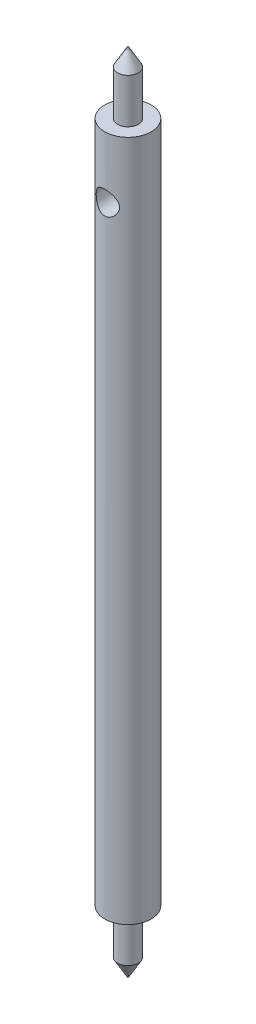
ISO-10303-21;
HEADER;
FILE_DESCRIPTION(('STEP AP214'),'2;1');
FILE_NAME('part.step','',(''),(''),'','','');
FILE_SCHEMA(('AUTOMOTIVE_DESIGN { 1 0 10303 214 1 1 1 1 }'));
ENDSEC;
DATA;
#1=APPLICATION_CONTEXT('core data for automotive mechanical design processes');
#2=APPLICATION_PROTOCOL_DEFINITION('international standard','automotive_design',2000,#1);
#3=PRODUCT_CONTEXT('',#1,'mechanical');
#4=PRODUCT('Part','Part','',(#3));
#5=PRODUCT_RELATED_PRODUCT_CATEGORY('part','',(#4));
#6=PRODUCT_DEFINITION_FORMATION('','',#4);
#7=PRODUCT_DEFINITION_CONTEXT('part definition',#1,'design');
#8=PRODUCT_DEFINITION('design','',#6,#7);
#9=PRODUCT_DEFINITION_SHAPE('','',#8);
#10=(LENGTH_UNIT() NAMED_UNIT(*) SI_UNIT(.MILLI.,.METRE.));
#11=(NAMED_UNIT(*) PLANE_ANGLE_UNIT() SI_UNIT($,.RADIAN.));
#12=(NAMED_UNIT(*) SI_UNIT($,.STERADIAN.) SOLID_ANGLE_UNIT());
#13=UNCERTAINTY_MEASURE_WITH_UNIT(LENGTH_MEASURE(1.E-05),#10,'distance_accuracy_value','');
#14=(GEOMETRIC_REPRESENTATION_CONTEXT(3) GLOBAL_UNCERTAINTY_ASSIGNED_CONTEXT((#13)) GLOBAL_UNIT_ASSIGNED_CONTEXT((#10,
#11,#12)) REPRESENTATION_CONTEXT('',''));
#15=CARTESIAN_POINT('',(0.,0.,0.));
#16=DIRECTION('',(0.,0.,1.));
#17=DIRECTION('',(1.,0.,0.));
#18=AXIS2_PLACEMENT_3D('',#15,#16,#17);
#19=CARTESIAN_POINT('',(0.,69.85,0.));
#20=DIRECTION('',(0.,-1.,0.));
#21=DIRECTION('',(0.,0.,-1.));
#22=AXIS2_PLACEMENT_3D('',#19,#20,#21);
#23=CYLINDRICAL_SURFACE('',#22,2.38125);
#24=CARTESIAN_POINT('',(0.,64.7603768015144,-2.38125));
#25=CARTESIAN_POINT('',(-0.0625934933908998,64.7603728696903,-2.38124658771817));
#26=CARTESIAN_POINT('',(-0.12526160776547,64.7554118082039,-2.37875553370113));
#27=CARTESIAN_POINT('',(-0.24874565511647,64.7357869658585,-2.36903604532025));
#28=CARTESIAN_POINT('',(-0.309557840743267,64.7211047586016,-2.36179861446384));
#29=CARTESIAN_POINT('',(-0.427355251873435,64.6827554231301,-2.34334382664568));
#30=CARTESIAN_POINT('',(-0.484354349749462,64.6591232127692,-2.33214194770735));
#31=CARTESIAN_POINT('',(-0.593493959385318,64.6037255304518,-2.30678565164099));
#32=CARTESIAN_POINT('',(-0.645634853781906,64.5719606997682,-2.29263146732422));
#33=CARTESIAN_POINT('',(-0.747126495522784,64.499014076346,-2.26166669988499));
#34=CARTESIAN_POINT('',(-0.796117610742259,64.4573788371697,-2.24474721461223));
#35=CARTESIAN_POINT('',(-0.88675302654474,64.3668496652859,-2.2105140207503));
#36=CARTESIAN_POINT('',(-0.928391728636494,64.3179502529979,-2.19320002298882));
#37=CARTESIAN_POINT('',(-1.00637816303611,64.2097325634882,-2.15859063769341));
#38=CARTESIAN_POINT('',(-1.04206516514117,64.1499003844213,-2.14140081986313));
#39=CARTESIAN_POINT('',(-1.10271904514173,64.0241331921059,-2.11081118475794));
#40=CARTESIAN_POINT('',(-1.12769358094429,63.9582025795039,-2.09740866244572));
#41=CARTESIAN_POINT('',(-1.16458893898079,63.8261349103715,-2.07713897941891));
#42=CARTESIAN_POINT('',(-1.1772017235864,63.7602465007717,-2.06992860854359));
#43=CARTESIAN_POINT('',(-1.19113338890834,63.6269269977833,-2.06194687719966));
#44=CARTESIAN_POINT('',(-1.19246343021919,63.5594974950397,-2.06116915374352));
#45=CARTESIAN_POINT('',(-1.18429955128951,63.433680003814,-2.06586451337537));
#46=CARTESIAN_POINT('',(-1.17608099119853,63.3751750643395,-2.07060121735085));
#47=CARTESIAN_POINT('',(-1.15126275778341,63.2605204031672,-2.08450134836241));
#48=CARTESIAN_POINT('',(-1.13466041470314,63.2043714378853,-2.09366618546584));
#49=CARTESIAN_POINT('',(-1.09324351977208,63.0944196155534,-2.1155915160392));
#50=CARTESIAN_POINT('',(-1.06824668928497,63.0407018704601,-2.12843079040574));
#51=CARTESIAN_POINT('',(-1.01089025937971,62.9379653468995,-2.15626240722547));
#52=CARTESIAN_POINT('',(-0.978527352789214,62.8889486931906,-2.17125571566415));
#53=CARTESIAN_POINT('',(-0.902572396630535,62.790462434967,-2.204003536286));
#54=CARTESIAN_POINT('',(-0.858076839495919,62.7417234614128,-2.22186710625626));
#55=CARTESIAN_POINT('',(-0.76147086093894,62.6520949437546,-2.25680138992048));
#56=CARTESIAN_POINT('',(-0.709356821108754,62.6112091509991,-2.27387172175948));
#57=CARTESIAN_POINT('',(-0.595927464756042,62.5366635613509,-2.30626428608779));
#58=CARTESIAN_POINT('',(-0.534297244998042,62.5034274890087,-2.3214685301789));
#59=CARTESIAN_POINT('',(-0.405367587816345,62.4480675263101,-2.34741102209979));
#60=CARTESIAN_POINT('',(-0.338072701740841,62.4259348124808,-2.35815281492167));
#61=CARTESIAN_POINT('',(-0.20570010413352,62.3952295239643,-2.37320534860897));
#62=CARTESIAN_POINT('',(-0.140900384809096,62.3856856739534,-2.37797504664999));
#63=CARTESIAN_POINT('',(-0.0104532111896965,62.3773828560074,-2.38211931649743));
#64=CARTESIAN_POINT('',(0.0551938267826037,62.3786187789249,-2.38149644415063));
#65=CARTESIAN_POINT('',(0.180061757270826,62.391279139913,-2.37519200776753));
#66=CARTESIAN_POINT('',(0.239386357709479,62.4019064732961,-2.36990626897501));
#67=CARTESIAN_POINT('',(0.355290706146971,62.4317977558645,-2.35532022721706));
#68=CARTESIAN_POINT('',(0.411870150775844,62.451062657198,-2.34601948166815));
#69=CARTESIAN_POINT('',(0.522551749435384,62.4981874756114,-2.323912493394));
#70=CARTESIAN_POINT('',(0.576536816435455,62.5262773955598,-2.31101362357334));
#71=CARTESIAN_POINT('',(0.679205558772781,62.589995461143,-2.28295169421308));
#72=CARTESIAN_POINT('',(0.727886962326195,62.6256268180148,-2.26778767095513));
#73=CARTESIAN_POINT('',(0.823635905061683,62.7074540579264,-2.23490101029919));
#74=CARTESIAN_POINT('',(0.870075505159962,62.754343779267,-2.21707334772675));
#75=CARTESIAN_POINT('',(0.954710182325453,62.8552876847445,-2.18196785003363));
#76=CARTESIAN_POINT('',(0.992899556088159,62.9093467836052,-2.1646904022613));
#77=CARTESIAN_POINT('',(1.06168973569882,63.0264025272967,-2.13182825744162));
#78=CARTESIAN_POINT('',(1.0918334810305,63.0897052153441,-2.11636605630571));
#79=CARTESIAN_POINT('',(1.14071736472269,63.2215059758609,-2.090428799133));
#80=CARTESIAN_POINT('',(1.15947219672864,63.2899972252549,-2.07994732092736));
#81=CARTESIAN_POINT('',(1.18331657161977,63.4231980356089,-2.06646662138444));
#82=CARTESIAN_POINT('',(1.18954509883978,63.4876394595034,-2.06284572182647));
#83=CARTESIAN_POINT('',(1.19144552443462,63.6167184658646,-2.06175000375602));
#84=CARTESIAN_POINT('',(1.18712199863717,63.6813559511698,-2.06427252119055));
#85=CARTESIAN_POINT('',(1.16910579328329,63.802499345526,-2.07451954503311));
#86=CARTESIAN_POINT('',(1.1563448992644,63.8591932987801,-2.081725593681));
#87=CARTESIAN_POINT('',(1.12296816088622,63.9695733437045,-2.09991741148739));
#88=CARTESIAN_POINT('',(1.10234978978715,64.0232584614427,-2.11090439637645));
#89=CARTESIAN_POINT('',(1.05229312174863,64.1300895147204,-2.13632093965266));
#90=CARTESIAN_POINT('',(1.02235532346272,64.1829568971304,-2.15093219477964));
#91=CARTESIAN_POINT('',(0.955061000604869,64.2832630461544,-2.18164566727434));
#92=CARTESIAN_POINT('',(0.917700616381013,64.330698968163,-2.19774865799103));
#93=CARTESIAN_POINT('',(0.831298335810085,64.424789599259,-2.23197328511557));
#94=CARTESIAN_POINT('',(0.781388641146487,64.4706490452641,-2.25010245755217));
#95=CARTESIAN_POINT('',(0.674078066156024,64.5535211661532,-2.28454448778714));
#96=CARTESIAN_POINT('',(0.61667317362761,64.5905290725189,-2.30085636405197));
#97=CARTESIAN_POINT('',(0.495218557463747,64.6546925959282,-2.33002942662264));
#98=CARTESIAN_POINT('',(0.43112472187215,64.6817767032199,-2.34286539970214));
#99=CARTESIAN_POINT('',(0.298539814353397,64.724429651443,-2.36340659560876));
#100=CARTESIAN_POINT('',(0.230061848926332,64.7400312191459,-2.37112639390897));
#101=CARTESIAN_POINT('',(0.134066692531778,64.7531109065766,-2.37762409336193));
#102=CARTESIAN_POINT('',(0.107348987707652,64.7558317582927,-2.37898025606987));
#103=CARTESIAN_POINT('',(0.0537587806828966,64.7594655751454,-2.3807939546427));
#104=CARTESIAN_POINT('',(0.0268862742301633,64.7603784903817,-2.38125146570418));
#105=CARTESIAN_POINT('',(0.,64.7603768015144,-2.38125));
#106=B_SPLINE_CURVE_WITH_KNOTS('',3,(#24,#25,#26,#27,#28,#29,#30,#31,#32,#33,#34,#35,#36,#37,
#38,#39,#40,#41,#42,#43,#44,#45,#46,#47,#48,#49,#50,#51,#52,#53,#54,#55,#56,#57,#58,#59,#60,#61,
#62,#63,#64,#65,#66,#67,#68,#69,#70,#71,#72,#73,#74,#75,#76,#77,#78,#79,#80,#81,#82,#83,#84,#85,
#86,#87,#88,#89,#90,#91,#92,#93,#94,#95,#96,#97,#98,#99,#100,#101,#102,#103,#104,#105),
.UNSPECIFIED.,.T.,.F.,(4,2,2,2,2,2,2,2,2,2,2,2,2,2,2,2,2,2,2,2,2,2,2,2,2,2,2,2,2,2,2,2,2,2,2,2,
2,2,2,2,4),(0.,0.187671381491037,0.375699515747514,0.56300150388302,0.75028872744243,
0.948906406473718,1.14767467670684,1.36185743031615,1.5758868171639,1.77710320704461,
1.97812053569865,2.15509926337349,2.33213438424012,2.51329317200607,2.69453345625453,
2.8987544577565,3.10307277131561,3.31687910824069,3.53051527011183,3.72645730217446,
3.92230647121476,4.10297598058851,4.28366541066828,4.46952119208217,4.65545627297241,
4.85965036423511,5.06398516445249,5.27821543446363,5.49216872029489,5.6855833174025,
5.87891405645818,6.05382723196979,6.22879670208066,6.41552156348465,6.60234377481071,
6.81186617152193,7.02150118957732,7.2326184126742,7.44313156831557,7.52374130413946,
7.60435326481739),.UNSPECIFIED.);
#107=CARTESIAN_POINT('',(0.,64.7603768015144,-2.38125));
#108=VERTEX_POINT('',#107);
#109=EDGE_CURVE('E11',#108,#108,#106,.T.);
#110=ORIENTED_EDGE('',*,*,#109,.T.);
#111=EDGE_LOOP('',(#110));
#112=FACE_BOUND('',#111,.T.);
#113=CARTESIAN_POINT('',(1.190625,63.5697518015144,2.0622229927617));
#114=CARTESIAN_POINT('',(1.19062066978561,63.507710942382,2.06222839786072));
#115=CARTESIAN_POINT('',(1.18574340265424,63.4455917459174,2.06506525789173));
#116=CARTESIAN_POINT('',(1.16648294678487,63.3232599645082,2.07600192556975));
#117=CARTESIAN_POINT('',(1.15207978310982,63.2630516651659,2.084112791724));
#118=CARTESIAN_POINT('',(1.11454400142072,63.1465421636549,2.10442190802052));
#119=CARTESIAN_POINT('',(1.09145778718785,63.0902220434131,2.11659839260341));
#120=CARTESIAN_POINT('',(1.03735289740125,62.9822686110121,2.14363297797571));
#121=CARTESIAN_POINT('',(1.00633379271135,62.9306355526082,2.15849122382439));
#122=CARTESIAN_POINT('',(0.93424359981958,62.8288190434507,2.19071272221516));
#123=CARTESIAN_POINT('',(0.892554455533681,62.7791063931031,2.20818150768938));
#124=CARTESIAN_POINT('',(0.801592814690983,62.6870124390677,2.24280392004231));
#125=CARTESIAN_POINT('',(0.752316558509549,62.6446347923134,2.25995738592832));
#126=CARTESIAN_POINT('',(0.643520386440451,62.5656177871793,2.29339945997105));
#127=CARTESIAN_POINT('',(0.583533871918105,62.5295577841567,2.30955182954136));
#128=CARTESIAN_POINT('',(0.457386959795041,62.4682559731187,2.33780118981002));
#129=CARTESIAN_POINT('',(0.391230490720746,62.4430073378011,2.34990073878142));
#130=CARTESIAN_POINT('',(0.259609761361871,62.4059103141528,2.3679204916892));
#131=CARTESIAN_POINT('',(0.194431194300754,62.3932362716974,2.37421912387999));
#132=CARTESIAN_POINT('',(0.0625919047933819,62.378929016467,2.38134029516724));
#133=CARTESIAN_POINT('',(-0.00406789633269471,62.3772891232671,2.38216614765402));
#134=CARTESIAN_POINT('',(-0.130769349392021,62.3847783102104,2.37842800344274));
#135=CARTESIAN_POINT('',(-0.190882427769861,62.3929833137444,2.37432646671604));
#136=CARTESIAN_POINT('',(-0.308745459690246,62.4182755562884,2.36189335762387));
#137=CARTESIAN_POINT('',(-0.366495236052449,62.4353634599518,2.353561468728));
#138=CARTESIAN_POINT('',(-0.478999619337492,62.4780469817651,2.33328666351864));
#139=CARTESIAN_POINT('',(-0.53370173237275,62.5037570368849,2.32129538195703));
#140=CARTESIAN_POINT('',(-0.638147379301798,62.5627966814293,2.294782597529));
#141=CARTESIAN_POINT('',(-0.687889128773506,62.5961289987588,2.28026018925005));
#142=CARTESIAN_POINT('',(-0.786019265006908,62.6730865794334,2.24842857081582));
#143=CARTESIAN_POINT('',(-0.833835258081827,62.7173869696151,2.23098569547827));
#144=CARTESIAN_POINT('',(-0.921668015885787,62.8132164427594,2.19615949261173));
#145=CARTESIAN_POINT('',(-0.96167878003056,62.8647510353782,2.17877622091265));
#146=CARTESIAN_POINT('',(-1.03525478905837,62.9775923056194,2.14484135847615));
#147=CARTESIAN_POINT('',(-1.06824936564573,63.0393117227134,2.12841268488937));
#148=CARTESIAN_POINT('',(-1.12313931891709,63.1684369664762,2.0999702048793));
#149=CARTESIAN_POINT('',(-1.14504627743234,63.235836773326,2.08795179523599));
#150=CARTESIAN_POINT('',(-1.17536143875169,63.3687915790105,2.07102832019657));
#151=CARTESIAN_POINT('',(-1.18470178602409,63.4340695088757,2.06563502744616));
#152=CARTESIAN_POINT('',(-1.19243111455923,63.5654671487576,2.06118522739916));
#153=CARTESIAN_POINT('',(-1.1908278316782,63.6315862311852,2.06212424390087));
#154=CARTESIAN_POINT('',(-1.17757103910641,63.7550772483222,2.06971506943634));
#155=CARTESIAN_POINT('',(-1.16703611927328,63.8126148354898,2.0757307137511));
#156=CARTESIAN_POINT('',(-1.1378758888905,63.9249959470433,2.09185694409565));
#157=CARTESIAN_POINT('',(-1.11924795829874,63.9798385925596,2.10196885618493));
#158=CARTESIAN_POINT('',(-1.0735241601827,64.0881634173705,2.12569689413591));
#159=CARTESIAN_POINT('',(-1.04607605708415,64.1414649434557,2.13945362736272));
#160=CARTESIAN_POINT('',(-0.983798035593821,64.2430136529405,2.16879629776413));
#161=CARTESIAN_POINT('',(-0.948964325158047,64.2912582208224,2.18438317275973));
#162=CARTESIAN_POINT('',(-0.867771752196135,64.3876858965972,2.21799148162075));
#163=CARTESIAN_POINT('',(-0.820513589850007,64.4350946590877,2.23607213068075));
#164=CARTESIAN_POINT('',(-0.71842847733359,64.5215519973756,2.27092948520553));
#165=CARTESIAN_POINT('',(-0.663598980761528,64.5605977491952,2.28770574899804));
#166=CARTESIAN_POINT('',(-0.545943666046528,64.6300911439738,2.31863933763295));
#167=CARTESIAN_POINT('',(-0.482945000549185,64.6602846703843,2.3327158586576));
#168=CARTESIAN_POINT('',(-0.351856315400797,64.7093441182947,2.35604869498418));
#169=CARTESIAN_POINT('',(-0.28377082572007,64.7282199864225,2.36530924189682));
#170=CARTESIAN_POINT('',(-0.151185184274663,64.7524812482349,2.37729126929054));
#171=CARTESIAN_POINT('',(-0.0869292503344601,64.7589455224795,2.3805347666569));
#172=CARTESIAN_POINT('',(0.0418218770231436,64.7613808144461,2.38175161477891));
#173=CARTESIAN_POINT('',(0.10631697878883,64.7573555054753,2.37972681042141));
#174=CARTESIAN_POINT('',(0.229240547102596,64.7396403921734,2.37093881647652));
#175=CARTESIAN_POINT('',(0.287788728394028,64.726604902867,2.36449665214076));
#176=CARTESIAN_POINT('',(0.401771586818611,64.6921218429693,2.34781836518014));
#177=CARTESIAN_POINT('',(0.457205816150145,64.6706730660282,2.33758169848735));
#178=CARTESIAN_POINT('',(0.566050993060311,64.6190174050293,2.31369311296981));
#179=CARTESIAN_POINT('',(0.619273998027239,64.5884751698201,2.2999138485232));
#180=CARTESIAN_POINT('',(0.720059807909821,64.5199206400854,2.27038058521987));
#181=CARTESIAN_POINT('',(0.767619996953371,64.4819049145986,2.25462568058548));
#182=CARTESIAN_POINT('',(0.860719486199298,64.3950964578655,2.22085626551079));
#183=CARTESIAN_POINT('',(0.905586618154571,64.3456077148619,2.20277291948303));
#184=CARTESIAN_POINT('',(0.986627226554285,64.2395370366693,2.16768850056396));
#185=CARTESIAN_POINT('',(1.02279301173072,64.1829488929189,2.15068839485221));
#186=CARTESIAN_POINT('',(1.08636325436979,64.061912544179,2.11930780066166));
#187=CARTESIAN_POINT('',(1.11345471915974,63.9972724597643,2.10502707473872));
#188=CARTESIAN_POINT('',(1.15595246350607,63.8634404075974,2.08200017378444));
#189=CARTESIAN_POINT('',(1.17139782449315,63.7942645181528,2.07323550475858));
#190=CARTESIAN_POINT('',(1.18391821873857,63.6985710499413,2.06608290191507));
#191=CARTESIAN_POINT('',(1.18642936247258,63.672898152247,2.06464053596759));
#192=CARTESIAN_POINT('',(1.18978371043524,63.6214053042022,2.06270942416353));
#193=CARTESIAN_POINT('',(1.19062680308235,63.59558534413,2.06222074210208));
#194=CARTESIAN_POINT('',(1.190625,63.5697518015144,2.0622229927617));
#195=B_SPLINE_CURVE_WITH_KNOTS('',3,(#113,#114,#115,#116,#117,#118,#119,#120,#121,#122,#123,
#124,#125,#126,#127,#128,#129,#130,#131,#132,#133,#134,#135,#136,#137,#138,#139,#140,#141,#142,
#143,#144,#145,#146,#147,#148,#149,#150,#151,#152,#153,#154,#155,#156,#157,#158,#159,#160,#161,
#162,#163,#164,#165,#166,#167,#168,#169,#170,#171,#172,#173,#174,#175,#176,#177,#178,#179,#180,
#181,#182,#183,#184,#185,#186,#187,#188,#189,#190,#191,#192,#193,#194),.UNSPECIFIED.,.T.,.F.,(4,
2,2,2,2,2,2,2,2,2,2,2,2,2,2,2,2,2,2,2,2,2,2,2,2,2,2,2,2,2,2,2,2,2,2,2,2,2,2,2,4),(0.,
0.18601387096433,0.372419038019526,0.557841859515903,0.743274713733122,0.944001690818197,
1.14482845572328,1.35919240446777,1.57342078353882,1.77240586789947,1.9712704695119,
2.15284166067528,2.33442643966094,2.5185235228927,2.70268659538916,2.90425812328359,
3.10598401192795,3.32052027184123,3.5348319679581,3.73216040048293,3.92934935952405,
4.1049676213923,4.28064278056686,4.46445437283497,4.64836057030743,4.85544904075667,
5.06260732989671,5.27523290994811,5.48767134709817,5.68061796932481,5.87349703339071,
6.0536664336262,6.23386167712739,6.42176393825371,6.60975266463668,6.81645006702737,
7.0233295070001,7.23674673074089,7.44944455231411,7.52689473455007,7.60435009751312),.UNSPECIFIED.);
#196=CARTESIAN_POINT('',(1.190625,63.5697518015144,2.0622229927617));
#197=VERTEX_POINT('',#196);
#198=EDGE_CURVE('E52',#197,#197,#195,.T.);
#199=ORIENTED_EDGE('',*,*,#198,.T.);
#200=EDGE_LOOP('',(#199));
#201=FACE_BOUND('',#200,.T.);
#202=CARTESIAN_POINT('',(0.,69.85,0.));
#203=DIRECTION('',(0.,1.,0.));
#204=DIRECTION('',(0.,0.,1.));
#205=AXIS2_PLACEMENT_3D('',#202,#203,#204);
#206=CIRCLE('',#205,2.38125);
#207=CARTESIAN_POINT('',(0.,69.85,2.38125));
#208=VERTEX_POINT('',#207);
#209=EDGE_CURVE('E90',#208,#208,#206,.T.);
#210=ORIENTED_EDGE('',*,*,#209,.F.);
#211=EDGE_LOOP('',(#210));
#212=FACE_BOUND('',#211,.T.);
#213=CARTESIAN_POINT('',(0.,0.,0.));
#214=DIRECTION('',(0.,1.,0.));
#215=DIRECTION('',(0.,0.,1.));
#216=AXIS2_PLACEMENT_3D('',#213,#214,#215);
#217=CIRCLE('',#216,2.38125);
#218=CARTESIAN_POINT('',(0.,0.,2.38125));
#219=VERTEX_POINT('',#218);
#220=EDGE_CURVE('E93',#219,#219,#217,.T.);
#221=ORIENTED_EDGE('',*,*,#220,.T.);
#222=EDGE_LOOP('',(#221));
#223=FACE_BOUND('',#222,.T.);
#224=ADVANCED_FACE('F39',(#112,#201,#212,#223),#23,.T.);
#225=CARTESIAN_POINT('',(0.,69.85,0.));
#226=DIRECTION('',(0.,1.,0.));
#227=DIRECTION('',(0.,0.,1.));
#228=AXIS2_PLACEMENT_3D('',#225,#226,#227);
#229=PLANE('',#228);
#230=CARTESIAN_POINT('',(0.,69.85,0.));
#231=DIRECTION('',(0.,1.,0.));
#232=DIRECTION('',(0.,0.,1.));
#233=AXIS2_PLACEMENT_3D('',#230,#231,#232);
#234=CIRCLE('',#233,1.0668);
#235=CARTESIAN_POINT('',(0.,69.85,1.0668));
#236=VERTEX_POINT('',#235);
#237=EDGE_CURVE('E100',#236,#236,#234,.T.);
#238=ORIENTED_EDGE('',*,*,#237,.F.);
#239=EDGE_LOOP('',(#238));
#240=FACE_BOUND('',#239,.T.);
#241=ORIENTED_EDGE('',*,*,#209,.T.);
#242=EDGE_LOOP('',(#241));
#243=FACE_BOUND('',#242,.T.);
#244=ADVANCED_FACE('F74',(#240,#243),#229,.T.);
#245=CARTESIAN_POINT('',(0.,0.,0.));
#246=DIRECTION('',(0.,1.,0.));
#247=DIRECTION('',(0.,0.,1.));
#248=AXIS2_PLACEMENT_3D('',#245,#246,#247);
#249=PLANE('',#248);
#250=CARTESIAN_POINT('',(0.,0.,0.));
#251=DIRECTION('',(0.,-1.,0.));
#252=DIRECTION('',(0.,0.,-1.));
#253=AXIS2_PLACEMENT_3D('',#250,#251,#252);
#254=CIRCLE('',#253,1.0668);
#255=CARTESIAN_POINT('',(0.,0.,-1.0668));
#256=VERTEX_POINT('',#255);
#257=EDGE_CURVE('E109',#256,#256,#254,.T.);
#258=ORIENTED_EDGE('',*,*,#257,.F.);
#259=EDGE_LOOP('',(#258));
#260=FACE_BOUND('',#259,.T.);
#261=ORIENTED_EDGE('',*,*,#220,.F.);
#262=EDGE_LOOP('',(#261));
#263=FACE_BOUND('',#262,.T.);
#264=ADVANCED_FACE('F79',(#260,#263),#249,.F.);
#265=CARTESIAN_POINT('',(0.,74.422,0.));
#266=DIRECTION('',(0.,-1.,0.));
#267=DIRECTION('',(0.,0.,-1.));
#268=AXIS2_PLACEMENT_3D('',#265,#266,#267);
#269=CYLINDRICAL_SURFACE('',#268,1.0668);
#270=CARTESIAN_POINT('',(0.,74.422,0.));
#271=DIRECTION('',(0.,1.,0.));
#272=DIRECTION('',(0.,0.,1.));
#273=AXIS2_PLACEMENT_3D('',#270,#271,#272);
#274=CIRCLE('',#273,1.0668);
#275=CARTESIAN_POINT('',(0.,74.422,1.0668));
#276=VERTEX_POINT('',#275);
#277=EDGE_CURVE('E96',#276,#276,#274,.T.);
#278=ORIENTED_EDGE('',*,*,#277,.F.);
#279=EDGE_LOOP('',(#278));
#280=FACE_BOUND('',#279,.T.);
#281=ORIENTED_EDGE('',*,*,#237,.T.);
#282=EDGE_LOOP('',(#281));
#283=FACE_BOUND('',#282,.T.);
#284=ADVANCED_FACE('F125',(#280,#283),#269,.T.);
#285=CARTESIAN_POINT('',(0.,-4.572,0.));
#286=DIRECTION('',(0.,1.,0.));
#287=DIRECTION('',(0.,0.,1.));
#288=AXIS2_PLACEMENT_3D('',#285,#286,#287);
#289=CYLINDRICAL_SURFACE('',#288,1.0668);
#290=CARTESIAN_POINT('',(0.,-4.572,0.));
#291=DIRECTION('',(0.,-1.,0.));
#292=DIRECTION('',(0.,0.,-1.));
#293=AXIS2_PLACEMENT_3D('',#290,#291,#292);
#294=CIRCLE('',#293,1.0668);
#295=CARTESIAN_POINT('',(0.,-4.572,-1.0668));
#296=VERTEX_POINT('',#295);
#297=EDGE_CURVE('E102',#296,#296,#294,.T.);
#298=ORIENTED_EDGE('',*,*,#297,.F.);
#299=EDGE_LOOP('',(#298));
#300=FACE_BOUND('',#299,.T.);
#301=ORIENTED_EDGE('',*,*,#257,.T.);
#302=EDGE_LOOP('',(#301));
#303=FACE_BOUND('',#302,.T.);
#304=ADVANCED_FACE('F69',(#300,#303),#289,.T.);
#305=CARTESIAN_POINT('',(0.,-6.41975180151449,0.));
#306=DIRECTION('',(0.,1.,0.));
#307=DIRECTION('',(0.,0.,1.));
#308=AXIS2_PLACEMENT_3D('',#305,#306,#307);
#309=CONICAL_SURFACE('',#308,0.,0.523598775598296);
#310=ORIENTED_EDGE('',*,*,#297,.T.);
#311=EDGE_LOOP('',(#310));
#312=FACE_BOUND('',#311,.T.);
#313=CARTESIAN_POINT('',(0.,-6.41975180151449,0.));
#314=VERTEX_POINT('',#313);
#315=VERTEX_LOOP('',#314);
#316=FACE_BOUND('',#315,.T.);
#317=ADVANCED_FACE('F61',(#312,#316),#309,.T.);
#318=CARTESIAN_POINT('',(0.,76.2697518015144,0.));
#319=DIRECTION('',(0.,-1.,0.));
#320=DIRECTION('',(0.,0.,-1.));
#321=AXIS2_PLACEMENT_3D('',#318,#319,#320);
#322=CONICAL_SURFACE('',#321,0.,0.523598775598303);
#323=ORIENTED_EDGE('',*,*,#277,.T.);
#324=EDGE_LOOP('',(#323));
#325=FACE_BOUND('',#324,.T.);
#326=CARTESIAN_POINT('',(0.,76.2697518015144,0.));
#327=VERTEX_POINT('',#326);
#328=VERTEX_LOOP('',#327);
#329=FACE_BOUND('',#328,.T.);
#330=ADVANCED_FACE('F58',(#325,#329),#322,.T.);
#331=CARTESIAN_POINT('',(0.,63.5697518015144,-2.38125));
#332=DIRECTION('',(0.,0.,1.));
#333=DIRECTION('',(1.,0.,0.));
#334=AXIS2_PLACEMENT_3D('',#331,#332,#333);
#335=CYLINDRICAL_SURFACE('',#334,1.190625);
#336=ORIENTED_EDGE('',*,*,#198,.F.);
#337=EDGE_LOOP('',(#336));
#338=FACE_BOUND('',#337,.T.);
#339=ORIENTED_EDGE('',*,*,#109,.F.);
#340=EDGE_LOOP('',(#339));
#341=FACE_BOUND('',#340,.T.);
#342=ADVANCED_FACE('F60',(#338,#341),#335,.F.);
#343=CLOSED_SHELL('',(#224,#244,#264,#284,#304,#317,#330,#342));
#344=MANIFOLD_SOLID_BREP('B2',#343);
#345=ADVANCED_BREP_SHAPE_REPRESENTATION('',(#18,#344),#14);
#346=SHAPE_DEFINITION_REPRESENTATION(#9,#345);
ENDSEC;
END-ISO-10303-21;
